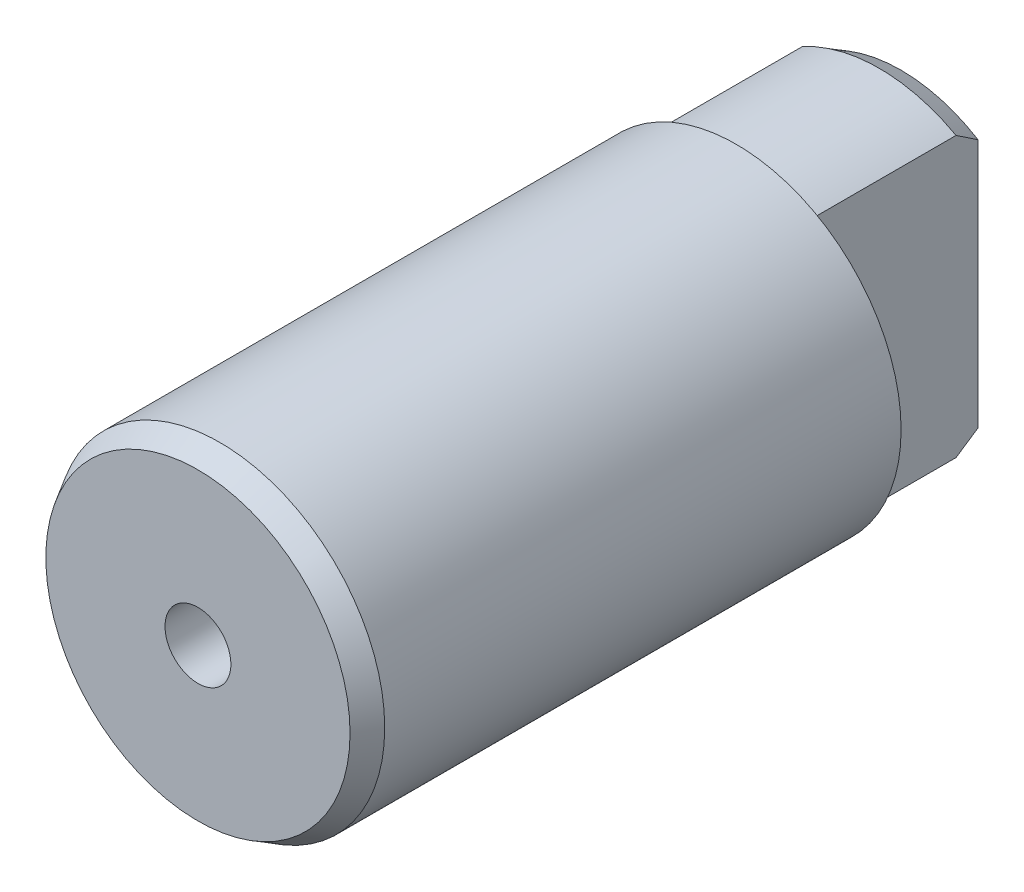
ISO-10303-21;
HEADER;
FILE_DESCRIPTION(('STEP AP214'),'2;1');
FILE_NAME('part.step','',(''),(''),'','','');
FILE_SCHEMA(('AUTOMOTIVE_DESIGN { 1 0 10303 214 1 1 1 1 }'));
ENDSEC;
DATA;
#1=APPLICATION_CONTEXT('core data for automotive mechanical design processes');
#2=APPLICATION_PROTOCOL_DEFINITION('international standard','automotive_design',2000,#1);
#3=PRODUCT_CONTEXT('',#1,'mechanical');
#4=PRODUCT('Part','Part','',(#3));
#5=PRODUCT_RELATED_PRODUCT_CATEGORY('part','',(#4));
#6=PRODUCT_DEFINITION_FORMATION('','',#4);
#7=PRODUCT_DEFINITION_CONTEXT('part definition',#1,'design');
#8=PRODUCT_DEFINITION('design','',#6,#7);
#9=PRODUCT_DEFINITION_SHAPE('','',#8);
#10=(LENGTH_UNIT() NAMED_UNIT(*) SI_UNIT(.MILLI.,.METRE.));
#11=(NAMED_UNIT(*) PLANE_ANGLE_UNIT() SI_UNIT($,.RADIAN.));
#12=(NAMED_UNIT(*) SI_UNIT($,.STERADIAN.) SOLID_ANGLE_UNIT());
#13=UNCERTAINTY_MEASURE_WITH_UNIT(LENGTH_MEASURE(1.E-05),#10,'distance_accuracy_value','');
#14=(GEOMETRIC_REPRESENTATION_CONTEXT(3) GLOBAL_UNCERTAINTY_ASSIGNED_CONTEXT((#13)) GLOBAL_UNIT_ASSIGNED_CONTEXT((#10,
#11,#12)) REPRESENTATION_CONTEXT('',''));
#15=CARTESIAN_POINT('',(0.,0.,0.));
#16=DIRECTION('',(0.,0.,1.));
#17=DIRECTION('',(1.,0.,0.));
#18=AXIS2_PLACEMENT_3D('',#15,#16,#17);
#19=CARTESIAN_POINT('',(0.,0.,-13.));
#20=DIRECTION('',(0.,0.,1.));
#21=DIRECTION('',(1.,0.,0.));
#22=AXIS2_PLACEMENT_3D('',#19,#20,#21);
#23=CONICAL_SURFACE('',#22,14.5,0.523598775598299);
#24=CARTESIAN_POINT('',(-7.,-6.26525366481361,-21.8432828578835));
#25=CARTESIAN_POINT('',(-7.,-6.38929352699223,-21.699985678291));
#26=CARTESIAN_POINT('',(-7.,-6.51217454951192,-21.5556942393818));
#27=CARTESIAN_POINT('',(-7.,-6.75585206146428,-21.2653731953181));
#28=CARTESIAN_POINT('',(-7.,-6.8766486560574,-21.1193436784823));
#29=CARTESIAN_POINT('',(-7.,-7.23622646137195,-20.679067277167));
#30=CARTESIAN_POINT('',(-7.,-7.47225099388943,-20.3825681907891));
#31=CARTESIAN_POINT('',(-7.,-7.93822692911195,-19.7851735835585));
#32=CARTESIAN_POINT('',(-7.,-8.16818226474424,-19.4842811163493));
#33=CARTESIAN_POINT('',(-7.,-8.62327976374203,-18.8788538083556));
#34=CARTESIAN_POINT('',(-7.,-8.84842161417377,-18.5743187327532));
#35=CARTESIAN_POINT('',(-7.,-9.29446758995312,-17.9626706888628));
#36=CARTESIAN_POINT('',(-7.,-9.51537603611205,-17.6555608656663));
#37=CARTESIAN_POINT('',(-7.,-9.95384133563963,-17.0389721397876));
#38=CARTESIAN_POINT('',(-7.,-10.1713982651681,-16.7294932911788));
#39=CARTESIAN_POINT('',(-7.,-10.8199387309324,-15.7979881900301));
#40=CARTESIAN_POINT('',(-7.,-11.2466990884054,-15.1730217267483));
#41=CARTESIAN_POINT('',(-7.,-12.0913453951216,-13.9184313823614));
#42=CARTESIAN_POINT('',(-7.,-12.5092430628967,-13.2888153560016));
#43=CARTESIAN_POINT('',(-7.,-13.3387604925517,-12.0254553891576));
#44=CARTESIAN_POINT('',(-7.,-13.7503801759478,-11.3917113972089));
#45=CARTESIAN_POINT('',(-7.,-14.5687137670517,-10.1210986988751));
#46=CARTESIAN_POINT('',(-7.,-14.975427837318,-9.48423009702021));
#47=CARTESIAN_POINT('',(-7.,-15.7849678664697,-8.20802583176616));
#48=CARTESIAN_POINT('',(-7.,-16.1877938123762,-7.5686901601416));
#49=CARTESIAN_POINT('',(-7.,-16.9910979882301,-6.28677759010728));
#50=CARTESIAN_POINT('',(-7.,-17.3915699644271,-5.64419677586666));
#51=CARTESIAN_POINT('',(-7.,-18.1899238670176,-4.357426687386));
#52=CARTESIAN_POINT('',(-7.,-18.5878057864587,-3.71323740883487));
#53=CARTESIAN_POINT('',(-7.,-19.3813765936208,-2.42360849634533));
#54=CARTESIAN_POINT('',(-7.,-19.7770657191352,-1.77816900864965));
#55=CARTESIAN_POINT('',(-7.,-20.5666212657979,-0.486182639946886));
#56=CARTESIAN_POINT('',(-7.,-20.9604877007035,0.160364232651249));
#57=CARTESIAN_POINT('',(-7.,-21.3536087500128,0.807362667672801));
#58=B_SPLINE_CURVE_WITH_KNOTS('',3,(#24,#25,#26,#27,#28,#29,#30,#31,#32,#33,#34,#35,#36,#37,#38,
#39,#40,#41,#42,#43,#44,#45,#46,#47,#48,#49,#50,#51,#52,#53,#54,#55,#56,#57),.UNSPECIFIED.,.F.,
.F.,(4,2,2,2,2,2,2,2,2,2,2,2,2,2,2,2,4),(0.,0.568560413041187,1.13709205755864,2.2739008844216,
3.40995399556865,4.54608074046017,5.68097844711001,6.81585032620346,9.08606924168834,
11.3530711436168,13.620101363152,15.8870562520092,18.1540187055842,20.4254847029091,
22.6969567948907,24.9681775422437,27.2393811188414),.UNSPECIFIED.);
#59=CARTESIAN_POINT('',(-7.,-11.36208685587,-15.));
#60=VERTEX_POINT('',#59);
#61=CARTESIAN_POINT('',(-7.,-12.6984250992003,-13.));
#62=VERTEX_POINT('',#61);
#63=EDGE_CURVE('E29',#60,#62,#58,.T.);
#64=ORIENTED_EDGE('',*,*,#63,.F.);
#65=CARTESIAN_POINT('',(0.,0.,-15.));
#66=DIRECTION('',(0.,0.,1.));
#67=DIRECTION('',(1.,0.,0.));
#68=AXIS2_PLACEMENT_3D('',#65,#66,#67);
#69=CIRCLE('',#68,13.3452994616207);
#70=CARTESIAN_POINT('',(7.,-11.36208685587,-15.));
#71=VERTEX_POINT('',#70);
#72=EDGE_CURVE('E99',#60,#71,#69,.T.);
#73=ORIENTED_EDGE('',*,*,#72,.T.);
#74=CARTESIAN_POINT('',(7.,-6.26525366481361,-21.8432828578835));
#75=CARTESIAN_POINT('',(7.,-6.38929352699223,-21.699985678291));
#76=CARTESIAN_POINT('',(7.,-6.51217454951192,-21.5556942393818));
#77=CARTESIAN_POINT('',(7.,-6.75585206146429,-21.2653731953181));
#78=CARTESIAN_POINT('',(7.,-6.87664865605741,-21.1193436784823));
#79=CARTESIAN_POINT('',(7.,-7.23622646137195,-20.679067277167));
#80=CARTESIAN_POINT('',(7.,-7.47225099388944,-20.3825681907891));
#81=CARTESIAN_POINT('',(7.,-7.93822692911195,-19.7851735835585));
#82=CARTESIAN_POINT('',(7.,-8.16818226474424,-19.4842811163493));
#83=CARTESIAN_POINT('',(7.,-8.62327976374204,-18.8788538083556));
#84=CARTESIAN_POINT('',(7.,-8.84842161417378,-18.5743187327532));
#85=CARTESIAN_POINT('',(7.,-9.29446758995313,-17.9626706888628));
#86=CARTESIAN_POINT('',(7.,-9.51537603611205,-17.6555608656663));
#87=CARTESIAN_POINT('',(7.,-9.95384133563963,-17.0389721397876));
#88=CARTESIAN_POINT('',(7.,-10.1713982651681,-16.7294932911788));
#89=CARTESIAN_POINT('',(7.,-10.8199387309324,-15.7979881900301));
#90=CARTESIAN_POINT('',(7.,-11.2466990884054,-15.1730217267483));
#91=CARTESIAN_POINT('',(7.,-12.0913453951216,-13.9184313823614));
#92=CARTESIAN_POINT('',(7.,-12.5092430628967,-13.2888153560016));
#93=CARTESIAN_POINT('',(7.,-13.3387604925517,-12.0254553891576));
#94=CARTESIAN_POINT('',(7.,-13.7503801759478,-11.3917113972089));
#95=CARTESIAN_POINT('',(7.,-14.5687137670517,-10.1210986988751));
#96=CARTESIAN_POINT('',(7.,-14.975427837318,-9.48423009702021));
#97=CARTESIAN_POINT('',(7.,-15.7849678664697,-8.20802583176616));
#98=CARTESIAN_POINT('',(7.,-16.1877938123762,-7.5686901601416));
#99=CARTESIAN_POINT('',(7.,-16.9910979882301,-6.28677759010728));
#100=CARTESIAN_POINT('',(7.,-17.3915699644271,-5.64419677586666));
#101=CARTESIAN_POINT('',(7.,-18.1899238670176,-4.357426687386));
#102=CARTESIAN_POINT('',(7.,-18.5878057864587,-3.71323740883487));
#103=CARTESIAN_POINT('',(7.,-19.3813765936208,-2.42360849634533));
#104=CARTESIAN_POINT('',(7.,-19.7770657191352,-1.77816900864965));
#105=CARTESIAN_POINT('',(7.,-20.5666212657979,-0.486182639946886));
#106=CARTESIAN_POINT('',(7.,-20.9604877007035,0.160364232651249));
#107=CARTESIAN_POINT('',(7.,-21.3536087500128,0.807362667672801));
#108=B_SPLINE_CURVE_WITH_KNOTS('',3,(#74,#75,#76,#77,#78,#79,#80,#81,#82,#83,#84,#85,#86,#87,
#88,#89,#90,#91,#92,#93,#94,#95,#96,#97,#98,#99,#100,#101,#102,#103,#104,#105,#106,#107),
.UNSPECIFIED.,.F.,.F.,(4,2,2,2,2,2,2,2,2,2,2,2,2,2,2,2,4),(0.,0.568560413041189,
1.13709205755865,2.27390088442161,3.40995399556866,4.54608074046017,5.68097844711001,
6.81585032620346,9.08606924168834,11.3530711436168,13.620101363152,15.8870562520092,
18.1540187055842,20.4254847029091,22.6969567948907,24.9681775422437,27.2393811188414),.UNSPECIFIED.);
#109=CARTESIAN_POINT('',(7.,-12.6984250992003,-13.));
#110=VERTEX_POINT('',#109);
#111=EDGE_CURVE('E86',#71,#110,#108,.T.);
#112=ORIENTED_EDGE('',*,*,#111,.T.);
#113=CARTESIAN_POINT('',(0.,0.,-13.));
#114=DIRECTION('',(0.,0.,1.));
#115=DIRECTION('',(1.,0.,0.));
#116=AXIS2_PLACEMENT_3D('',#113,#114,#115);
#117=CIRCLE('',#116,14.5);
#118=EDGE_CURVE('E84',#62,#110,#117,.T.);
#119=ORIENTED_EDGE('',*,*,#118,.F.);
#120=EDGE_LOOP('',(#64,#73,#112,#119));
#121=FACE_BOUND('',#120,.T.);
#122=ADVANCED_FACE('F14',(#121),#23,.T.);
#123=CARTESIAN_POINT('',(0.,0.,85.));
#124=DIRECTION('',(0.,0.,1.));
#125=DIRECTION('',(1.,0.,0.));
#126=AXIS2_PLACEMENT_3D('',#123,#124,#125);
#127=CYLINDRICAL_SURFACE('',#126,14.5);
#128=DIRECTION('',(0.,0.,1.));
#129=VECTOR('',#128,1.);
#130=CARTESIAN_POINT('',(-7.,12.6984250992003,85.));
#131=LINE('',#130,#129);
#132=CARTESIAN_POINT('',(-7.,12.6984250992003,0.));
#133=VERTEX_POINT('',#132);
#134=CARTESIAN_POINT('',(-7.,12.6984250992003,-13.));
#135=VERTEX_POINT('',#134);
#136=EDGE_CURVE('E152',#133,#135,#131,.F.);
#137=ORIENTED_EDGE('',*,*,#136,.F.);
#138=CARTESIAN_POINT('',(0.,0.,0.));
#139=DIRECTION('',(0.,0.,1.));
#140=DIRECTION('',(1.,0.,0.));
#141=AXIS2_PLACEMENT_3D('',#138,#139,#140);
#142=CIRCLE('',#141,14.5);
#143=CARTESIAN_POINT('',(7.,12.6984250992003,0.));
#144=VERTEX_POINT('',#143);
#145=EDGE_CURVE('E77',#144,#133,#142,.T.);
#146=ORIENTED_EDGE('',*,*,#145,.F.);
#147=DIRECTION('',(0.,0.,1.));
#148=VECTOR('',#147,1.);
#149=CARTESIAN_POINT('',(7.,12.6984250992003,85.));
#150=LINE('',#149,#148);
#151=CARTESIAN_POINT('',(7.,12.6984250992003,-13.));
#152=VERTEX_POINT('',#151);
#153=EDGE_CURVE('E9',#144,#152,#150,.F.);
#154=ORIENTED_EDGE('',*,*,#153,.T.);
#155=EDGE_CURVE('E96',#152,#135,#117,.T.);
#156=ORIENTED_EDGE('',*,*,#155,.T.);
#157=EDGE_LOOP('',(#137,#146,#154,#156));
#158=FACE_BOUND('',#157,.T.);
#159=ADVANCED_FACE('F130',(#158),#127,.T.);
#160=CARTESIAN_POINT('',(13.3452994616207,0.,-15.));
#161=DIRECTION('',(0.,0.,-1.));
#162=DIRECTION('',(-1.,0.,0.));
#163=AXIS2_PLACEMENT_3D('',#160,#161,#162);
#164=PLANE('',#163);
#165=DIRECTION('',(0.,1.,0.));
#166=VECTOR('',#165,1.);
#167=CARTESIAN_POINT('',(-7.,-20.,-15.));
#168=LINE('',#167,#166);
#169=CARTESIAN_POINT('',(-7.,11.36208685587,-15.));
#170=VERTEX_POINT('',#169);
#171=EDGE_CURVE('E72',#60,#170,#168,.T.);
#172=ORIENTED_EDGE('',*,*,#171,.T.);
#173=CARTESIAN_POINT('',(7.,11.36208685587,-15.));
#174=VERTEX_POINT('',#173);
#175=EDGE_CURVE('E100',#174,#170,#69,.T.);
#176=ORIENTED_EDGE('',*,*,#175,.F.);
#177=DIRECTION('',(0.,1.,0.));
#178=VECTOR('',#177,1.);
#179=CARTESIAN_POINT('',(7.,-20.,-15.));
#180=LINE('',#179,#178);
#181=EDGE_CURVE('E151',#71,#174,#180,.T.);
#182=ORIENTED_EDGE('',*,*,#181,.F.);
#183=ORIENTED_EDGE('',*,*,#72,.F.);
#184=EDGE_LOOP('',(#172,#176,#182,#183));
#185=FACE_BOUND('',#184,.T.);
#186=ADVANCED_FACE('F136',(#185),#164,.T.);
#187=CARTESIAN_POINT('',(-7.,21.3536087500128,0.807362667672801));
#188=CARTESIAN_POINT('',(-7.,20.9604877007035,0.16036423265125));
#189=CARTESIAN_POINT('',(-7.,20.5666212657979,-0.486182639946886));
#190=CARTESIAN_POINT('',(-7.,19.7770657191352,-1.77816900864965));
#191=CARTESIAN_POINT('',(-7.,19.3813765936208,-2.42360849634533));
#192=CARTESIAN_POINT('',(-7.,18.5878057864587,-3.71323740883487));
#193=CARTESIAN_POINT('',(-7.,18.1899238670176,-4.357426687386));
#194=CARTESIAN_POINT('',(-7.,17.3915699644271,-5.64419677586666));
#195=CARTESIAN_POINT('',(-7.,16.9910979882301,-6.28677759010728));
#196=CARTESIAN_POINT('',(-7.,16.1877938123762,-7.5686901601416));
#197=CARTESIAN_POINT('',(-7.,15.7849678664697,-8.20802583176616));
#198=CARTESIAN_POINT('',(-7.,14.975427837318,-9.48423009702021));
#199=CARTESIAN_POINT('',(-7.,14.5687137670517,-10.1210986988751));
#200=CARTESIAN_POINT('',(-7.,13.7503801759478,-11.3917113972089));
#201=CARTESIAN_POINT('',(-7.,13.3387604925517,-12.0254553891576));
#202=CARTESIAN_POINT('',(-7.,12.5092430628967,-13.2888153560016));
#203=CARTESIAN_POINT('',(-7.,12.0913453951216,-13.9184313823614));
#204=CARTESIAN_POINT('',(-7.,11.2466990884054,-15.1730217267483));
#205=CARTESIAN_POINT('',(-7.,10.8199387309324,-15.7979881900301));
#206=CARTESIAN_POINT('',(-7.,10.1713982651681,-16.7294932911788));
#207=CARTESIAN_POINT('',(-7.,9.95384133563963,-17.0389721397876));
#208=CARTESIAN_POINT('',(-7.,9.51537603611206,-17.6555608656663));
#209=CARTESIAN_POINT('',(-7.,9.29446758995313,-17.9626706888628));
#210=CARTESIAN_POINT('',(-7.,8.84842161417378,-18.5743187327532));
#211=CARTESIAN_POINT('',(-7.,8.62327976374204,-18.8788538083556));
#212=CARTESIAN_POINT('',(-7.,8.16818226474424,-19.4842811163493));
#213=CARTESIAN_POINT('',(-7.,7.93822692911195,-19.7851735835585));
#214=CARTESIAN_POINT('',(-7.,7.47225099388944,-20.3825681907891));
#215=CARTESIAN_POINT('',(-7.,7.23622646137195,-20.679067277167));
#216=CARTESIAN_POINT('',(-7.,6.87664865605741,-21.1193436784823));
#217=CARTESIAN_POINT('',(-7.,6.75585206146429,-21.2653731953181));
#218=CARTESIAN_POINT('',(-7.,6.51217454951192,-21.5556942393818));
#219=CARTESIAN_POINT('',(-7.,6.38929352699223,-21.699985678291));
#220=CARTESIAN_POINT('',(-7.,6.26525366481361,-21.8432828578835));
#221=B_SPLINE_CURVE_WITH_KNOTS('',3,(#187,#188,#189,#190,#191,#192,#193,#194,#195,#196,#197,
#198,#199,#200,#201,#202,#203,#204,#205,#206,#207,#208,#209,#210,#211,#212,#213,#214,#215,#216,
#217,#218,#219,#220),.UNSPECIFIED.,.F.,.F.,(4,2,2,2,2,2,2,2,2,2,2,2,2,2,2,2,4),(0.,
2.27120357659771,4.54242432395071,6.81389641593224,9.08536241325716,11.3523248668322,
13.6192797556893,15.8863099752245,18.1533118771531,20.4235307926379,21.5584026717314,
22.6933003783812,23.8294271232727,24.9654802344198,26.1022890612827,26.6708207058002,
27.2393811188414),.UNSPECIFIED.);
#222=EDGE_CURVE('E148',#135,#170,#221,.T.);
#223=ORIENTED_EDGE('',*,*,#222,.F.);
#224=ORIENTED_EDGE('',*,*,#155,.F.);
#225=CARTESIAN_POINT('',(7.,21.3536087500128,0.807362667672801));
#226=CARTESIAN_POINT('',(7.,20.9604877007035,0.16036423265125));
#227=CARTESIAN_POINT('',(7.,20.5666212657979,-0.486182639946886));
#228=CARTESIAN_POINT('',(7.,19.7770657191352,-1.77816900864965));
#229=CARTESIAN_POINT('',(7.,19.3813765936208,-2.42360849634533));
#230=CARTESIAN_POINT('',(7.,18.5878057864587,-3.71323740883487));
#231=CARTESIAN_POINT('',(7.,18.1899238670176,-4.357426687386));
#232=CARTESIAN_POINT('',(7.,17.3915699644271,-5.64419677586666));
#233=CARTESIAN_POINT('',(7.,16.9910979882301,-6.28677759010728));
#234=CARTESIAN_POINT('',(7.,16.1877938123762,-7.5686901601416));
#235=CARTESIAN_POINT('',(7.,15.7849678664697,-8.20802583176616));
#236=CARTESIAN_POINT('',(7.,14.975427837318,-9.48423009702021));
#237=CARTESIAN_POINT('',(7.,14.5687137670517,-10.1210986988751));
#238=CARTESIAN_POINT('',(7.,13.7503801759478,-11.3917113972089));
#239=CARTESIAN_POINT('',(7.,13.3387604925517,-12.0254553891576));
#240=CARTESIAN_POINT('',(7.,12.5092430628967,-13.2888153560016));
#241=CARTESIAN_POINT('',(7.,12.0913453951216,-13.9184313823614));
#242=CARTESIAN_POINT('',(7.,11.2466990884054,-15.1730217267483));
#243=CARTESIAN_POINT('',(7.,10.8199387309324,-15.7979881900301));
#244=CARTESIAN_POINT('',(7.,10.1713982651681,-16.7294932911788));
#245=CARTESIAN_POINT('',(7.,9.95384133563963,-17.0389721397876));
#246=CARTESIAN_POINT('',(7.,9.51537603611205,-17.6555608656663));
#247=CARTESIAN_POINT('',(7.,9.29446758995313,-17.9626706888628));
#248=CARTESIAN_POINT('',(7.,8.84842161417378,-18.5743187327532));
#249=CARTESIAN_POINT('',(7.,8.62327976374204,-18.8788538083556));
#250=CARTESIAN_POINT('',(7.,8.16818226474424,-19.4842811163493));
#251=CARTESIAN_POINT('',(7.,7.93822692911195,-19.7851735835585));
#252=CARTESIAN_POINT('',(7.,7.47225099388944,-20.3825681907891));
#253=CARTESIAN_POINT('',(7.,7.23622646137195,-20.679067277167));
#254=CARTESIAN_POINT('',(7.,6.8766486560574,-21.1193436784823));
#255=CARTESIAN_POINT('',(7.,6.75585206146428,-21.2653731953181));
#256=CARTESIAN_POINT('',(7.,6.51217454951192,-21.5556942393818));
#257=CARTESIAN_POINT('',(7.,6.38929352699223,-21.699985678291));
#258=CARTESIAN_POINT('',(7.,6.26525366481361,-21.8432828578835));
#259=B_SPLINE_CURVE_WITH_KNOTS('',3,(#225,#226,#227,#228,#229,#230,#231,#232,#233,#234,#235,
#236,#237,#238,#239,#240,#241,#242,#243,#244,#245,#246,#247,#248,#249,#250,#251,#252,#253,#254,
#255,#256,#257,#258),.UNSPECIFIED.,.F.,.F.,(4,2,2,2,2,2,2,2,2,2,2,2,2,2,2,2,4),(0.,
2.27120357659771,4.54242432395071,6.81389641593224,9.08536241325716,11.3523248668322,
13.6192797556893,15.8863099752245,18.1533118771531,20.4235307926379,21.5584026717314,
22.6933003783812,23.8294271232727,24.9654802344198,26.1022890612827,26.6708207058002,
27.2393811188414),.UNSPECIFIED.);
#260=EDGE_CURVE('E82',#152,#174,#259,.T.);
#261=ORIENTED_EDGE('',*,*,#260,.T.);
#262=ORIENTED_EDGE('',*,*,#175,.T.);
#263=EDGE_LOOP('',(#223,#224,#261,#262));
#264=FACE_BOUND('',#263,.T.);
#265=ADVANCED_FACE('F128',(#264),#23,.T.);
#266=DIRECTION('',(0.,0.,1.));
#267=VECTOR('',#266,1.);
#268=CARTESIAN_POINT('',(-7.,-12.6984250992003,85.));
#269=LINE('',#268,#267);
#270=CARTESIAN_POINT('',(-7.,-12.6984250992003,0.));
#271=VERTEX_POINT('',#270);
#272=EDGE_CURVE('E66',#62,#271,#269,.T.);
#273=ORIENTED_EDGE('',*,*,#272,.F.);
#274=ORIENTED_EDGE('',*,*,#118,.T.);
#275=DIRECTION('',(0.,0.,1.));
#276=VECTOR('',#275,1.);
#277=CARTESIAN_POINT('',(7.,-12.6984250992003,85.));
#278=LINE('',#277,#276);
#279=CARTESIAN_POINT('',(7.,-12.6984250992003,0.));
#280=VERTEX_POINT('',#279);
#281=EDGE_CURVE('E22',#110,#280,#278,.T.);
#282=ORIENTED_EDGE('',*,*,#281,.T.);
#283=EDGE_CURVE('E37',#271,#280,#142,.T.);
#284=ORIENTED_EDGE('',*,*,#283,.F.);
#285=EDGE_LOOP('',(#273,#274,#282,#284));
#286=FACE_BOUND('',#285,.T.);
#287=ADVANCED_FACE('F80',(#286),#127,.T.);
#288=CARTESIAN_POINT('',(15.,0.,0.));
#289=DIRECTION('',(0.,0.,-1.));
#290=DIRECTION('',(-1.,0.,0.));
#291=AXIS2_PLACEMENT_3D('',#288,#289,#290);
#292=PLANE('',#291);
#293=ORIENTED_EDGE('',*,*,#145,.T.);
#294=DIRECTION('',(0.,1.,0.));
#295=VECTOR('',#294,1.);
#296=CARTESIAN_POINT('',(-7.,-20.,0.));
#297=LINE('',#296,#295);
#298=EDGE_CURVE('E68',#271,#133,#297,.T.);
#299=ORIENTED_EDGE('',*,*,#298,.F.);
#300=ORIENTED_EDGE('',*,*,#283,.T.);
#301=DIRECTION('',(0.,1.,0.));
#302=VECTOR('',#301,1.);
#303=CARTESIAN_POINT('',(7.,-20.,0.));
#304=LINE('',#303,#302);
#305=EDGE_CURVE('E156',#280,#144,#304,.T.);
#306=ORIENTED_EDGE('',*,*,#305,.T.);
#307=EDGE_LOOP('',(#293,#299,#300,#306));
#308=FACE_BOUND('',#307,.T.);
#309=CARTESIAN_POINT('',(0.,0.,0.));
#310=DIRECTION('',(0.,0.,1.));
#311=DIRECTION('',(1.,0.,0.));
#312=AXIS2_PLACEMENT_3D('',#309,#310,#311);
#313=CIRCLE('',#312,15.);
#314=CARTESIAN_POINT('',(15.,0.,0.));
#315=VERTEX_POINT('',#314);
#316=EDGE_CURVE('E115',#315,#315,#313,.T.);
#317=ORIENTED_EDGE('',*,*,#316,.F.);
#318=EDGE_LOOP('',(#317));
#319=FACE_BOUND('',#318,.T.);
#320=ADVANCED_FACE('F16',(#308,#319),#292,.T.);
#321=CARTESIAN_POINT('',(0.,0.,85.));
#322=DIRECTION('',(0.,0.,1.));
#323=DIRECTION('',(1.,0.,0.));
#324=AXIS2_PLACEMENT_3D('',#321,#322,#323);
#325=CYLINDRICAL_SURFACE('',#324,15.);
#326=ORIENTED_EDGE('',*,*,#316,.T.);
#327=EDGE_LOOP('',(#326));
#328=FACE_BOUND('',#327,.T.);
#329=CARTESIAN_POINT('',(0.,0.,47.));
#330=DIRECTION('',(0.,0.,1.));
#331=DIRECTION('',(1.,0.,0.));
#332=AXIS2_PLACEMENT_3D('',#329,#330,#331);
#333=CIRCLE('',#332,15.);
#334=CARTESIAN_POINT('',(15.,0.,47.));
#335=VERTEX_POINT('',#334);
#336=EDGE_CURVE('E112',#335,#335,#333,.T.);
#337=ORIENTED_EDGE('',*,*,#336,.F.);
#338=EDGE_LOOP('',(#337));
#339=FACE_BOUND('',#338,.T.);
#340=ADVANCED_FACE('F119',(#328,#339),#325,.T.);
#341=CARTESIAN_POINT('',(0.,0.,47.));
#342=DIRECTION('',(0.,0.,-1.));
#343=DIRECTION('',(-1.,0.,0.));
#344=AXIS2_PLACEMENT_3D('',#341,#342,#343);
#345=CONICAL_SURFACE('',#344,15.,0.523598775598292);
#346=CARTESIAN_POINT('',(0.,0.,49.));
#347=DIRECTION('',(0.,0.,1.));
#348=DIRECTION('',(1.,0.,0.));
#349=AXIS2_PLACEMENT_3D('',#346,#347,#348);
#350=CIRCLE('',#349,13.8452994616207);
#351=CARTESIAN_POINT('',(13.8452994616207,0.,49.));
#352=VERTEX_POINT('',#351);
#353=EDGE_CURVE('E109',#352,#352,#350,.T.);
#354=ORIENTED_EDGE('',*,*,#353,.F.);
#355=EDGE_LOOP('',(#354));
#356=FACE_BOUND('',#355,.T.);
#357=ORIENTED_EDGE('',*,*,#336,.T.);
#358=EDGE_LOOP('',(#357));
#359=FACE_BOUND('',#358,.T.);
#360=ADVANCED_FACE('F127',(#356,#359),#345,.T.);
#361=CARTESIAN_POINT('',(3.,0.,49.));
#362=DIRECTION('',(0.,0.,1.));
#363=DIRECTION('',(1.,0.,0.));
#364=AXIS2_PLACEMENT_3D('',#361,#362,#363);
#365=PLANE('',#364);
#366=ORIENTED_EDGE('',*,*,#353,.T.);
#367=EDGE_LOOP('',(#366));
#368=FACE_BOUND('',#367,.T.);
#369=CARTESIAN_POINT('',(0.,0.,49.));
#370=DIRECTION('',(0.,0.,1.));
#371=DIRECTION('',(1.,0.,0.));
#372=AXIS2_PLACEMENT_3D('',#369,#370,#371);
#373=CIRCLE('',#372,3.);
#374=CARTESIAN_POINT('',(3.,0.,49.));
#375=VERTEX_POINT('',#374);
#376=EDGE_CURVE('E106',#375,#375,#373,.T.);
#377=ORIENTED_EDGE('',*,*,#376,.F.);
#378=EDGE_LOOP('',(#377));
#379=FACE_BOUND('',#378,.T.);
#380=ADVANCED_FACE('F211',(#368,#379),#365,.T.);
#381=CARTESIAN_POINT('',(0.,0.,85.));
#382=DIRECTION('',(0.,0.,1.));
#383=DIRECTION('',(1.,0.,0.));
#384=AXIS2_PLACEMENT_3D('',#381,#382,#383);
#385=CYLINDRICAL_SURFACE('',#384,3.);
#386=ORIENTED_EDGE('',*,*,#376,.T.);
#387=EDGE_LOOP('',(#386));
#388=FACE_BOUND('',#387,.T.);
#389=CARTESIAN_POINT('',(0.,0.,39.));
#390=DIRECTION('',(0.,0.,1.));
#391=DIRECTION('',(1.,0.,0.));
#392=AXIS2_PLACEMENT_3D('',#389,#390,#391);
#393=CIRCLE('',#392,3.);
#394=CARTESIAN_POINT('',(3.,0.,39.));
#395=VERTEX_POINT('',#394);
#396=EDGE_CURVE('E103',#395,#395,#393,.T.);
#397=ORIENTED_EDGE('',*,*,#396,.F.);
#398=EDGE_LOOP('',(#397));
#399=FACE_BOUND('',#398,.T.);
#400=ADVANCED_FACE('F202',(#388,#399),#385,.F.);
#401=CARTESIAN_POINT('',(0.,0.,39.));
#402=DIRECTION('',(0.,0.,1.));
#403=DIRECTION('',(1.,0.,0.));
#404=AXIS2_PLACEMENT_3D('',#401,#402,#403);
#405=PLANE('',#404);
#406=ORIENTED_EDGE('',*,*,#396,.T.);
#407=EDGE_LOOP('',(#406));
#408=FACE_BOUND('',#407,.T.);
#409=ADVANCED_FACE('F167',(#408),#405,.T.);
#410=CARTESIAN_POINT('',(7.,-20.,0.));
#411=DIRECTION('',(1.,0.,0.));
#412=DIRECTION('',(0.,0.,-1.));
#413=AXIS2_PLACEMENT_3D('',#410,#411,#412);
#414=PLANE('',#413);
#415=ORIENTED_EDGE('',*,*,#153,.F.);
#416=ORIENTED_EDGE('',*,*,#305,.F.);
#417=ORIENTED_EDGE('',*,*,#281,.F.);
#418=ORIENTED_EDGE('',*,*,#111,.F.);
#419=ORIENTED_EDGE('',*,*,#181,.T.);
#420=ORIENTED_EDGE('',*,*,#260,.F.);
#421=EDGE_LOOP('',(#415,#416,#417,#418,#419,#420));
#422=FACE_BOUND('',#421,.T.);
#423=ADVANCED_FACE('F155',(#422),#414,.T.);
#424=CARTESIAN_POINT('',(-7.,-20.,0.));
#425=DIRECTION('',(1.,0.,0.));
#426=DIRECTION('',(0.,0.,-1.));
#427=AXIS2_PLACEMENT_3D('',#424,#425,#426);
#428=PLANE('',#427);
#429=ORIENTED_EDGE('',*,*,#222,.T.);
#430=ORIENTED_EDGE('',*,*,#171,.F.);
#431=ORIENTED_EDGE('',*,*,#63,.T.);
#432=ORIENTED_EDGE('',*,*,#272,.T.);
#433=ORIENTED_EDGE('',*,*,#298,.T.);
#434=ORIENTED_EDGE('',*,*,#136,.T.);
#435=EDGE_LOOP('',(#429,#430,#431,#432,#433,#434));
#436=FACE_BOUND('',#435,.T.);
#437=ADVANCED_FACE('F67',(#436),#428,.F.);
#438=CLOSED_SHELL('',(#122,#159,#186,#265,#287,#320,#340,#360,#380,#400,#409,#423,#437));
#439=MANIFOLD_SOLID_BREP('B1',#438);
#440=ADVANCED_BREP_SHAPE_REPRESENTATION('',(#18,#439),#14);
#441=SHAPE_DEFINITION_REPRESENTATION(#9,#440);
ENDSEC;
END-ISO-10303-21;
